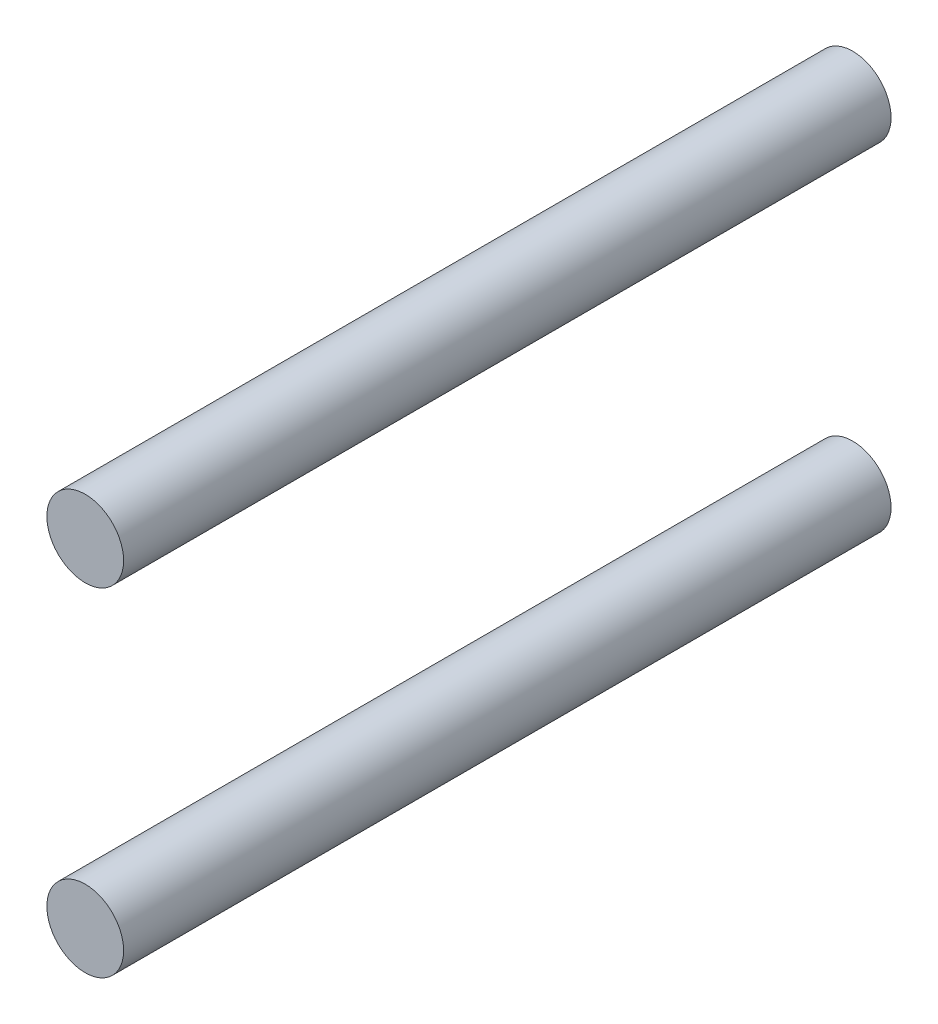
from build123d import *

# Parameters (mm, degrees)
SKETCH_1_R        = 2.5
EXTRUDE_1_DEPTH   = 50
EXTRUDE_1_2_DEPTH = 50


with BuildPart() as part:
    # Sketch 1 → Extrude 1 (new body)
    with BuildSketch(Plane.XY):
        with Locations((0, 12)):
            Circle(SKETCH_1_R)
    extrude(amount=EXTRUDE_1_DEPTH)


with BuildPart() as body_2:
    # Sketch 1 → Extrude 1 2 (new body)
    with BuildSketch(Plane.XY):
        with Locations((0, -10)):
            Circle(SKETCH_1_R)
    extrude(amount=EXTRUDE_1_2_DEPTH)


solid = Compound([part.part, body_2.part])
